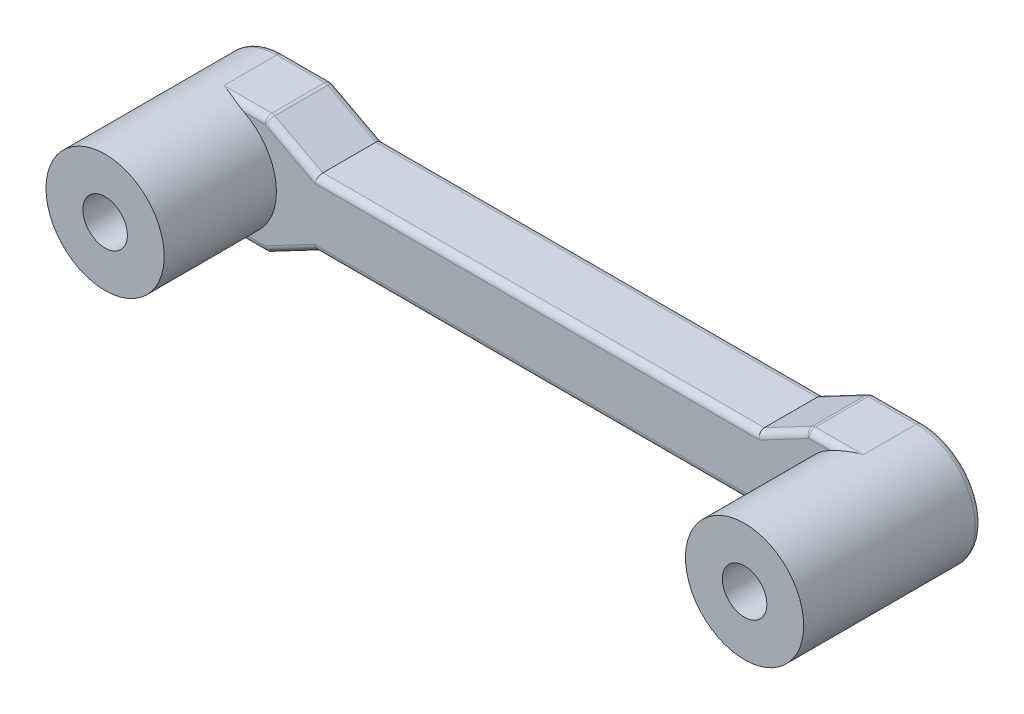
from build123d import *

# Parameters (mm, degrees)
SKETCH1_R           = 3.048
BOSS_EXTRUDE1_DEPTH = 5.08
CUT_EXTRUDE1_DEPTH  = 30.940958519
BOSS_EXTRUDE2_START = -5.08
SKETCH3_R           = 3.048
BOSS_EXTRUDE2_DEPTH = 5.08
FILLET1_R           = 0.508
SKETCH4_R           = 1.7145
CUT_EXTRUDE2_DEPTH  = 30.940958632
BOSS_EXTRUDE3_START = 4.572
SKETCH5_R           = 1.7145
BOSS_EXTRUDE3_DEPTH = 9.144


with BuildPart() as part:
    # Sketch1 → Boss-Extrude1 (new body)
    with BuildSketch(Plane.XY):
        with BuildLine():
            Line((-24.60625, 4.548), (24.60625, 4.548))
            ThreePointArc((24.60625, 4.548), (29.15425, 0), (24.60625, -4.548))
            Line((24.60625, -4.548), (-24.60625, -4.548))
            ThreePointArc((-24.60625, -4.548), (-29.15425, 0), (-24.60625, 4.548))
        make_face()
        with Locations((-24.60625, 0)):
            Circle(SKETCH1_R, mode=Mode.SUBTRACT)
        with Locations((24.60625, 0)):
            Circle(SKETCH1_R, mode=Mode.SUBTRACT)
    extrude(amount=BOSS_EXTRUDE1_DEPTH)

    # Sketch2 → Cut-Extrude1 (cut, through all)
    with BuildSketch(Plane.XY):
        Polygon((-20.79625, 4.548), (-16.98625, 2.54), (16.98625, 2.54), (20.79625, 4.548), align=None)
        Polygon((-16.98625, -2.54), (16.98625, -2.54), (20.79625, -4.548), (-20.79625, -4.548), align=None)
    extrude(amount=CUT_EXTRUDE1_DEPTH, mode=Mode.SUBTRACT)

    # Sketch3 → Boss-Extrude2 (add)
    with BuildSketch(Plane.XY.offset(5.08).offset(BOSS_EXTRUDE2_START)):
        with Locations((-24.60625, 0)):
            Circle(SKETCH3_R)
    boss_extrude2 = extrude(amount=BOSS_EXTRUDE2_DEPTH)

    # Mirror1: Boss-Extrude2 across plane
    add(boss_extrude2.mirror(Plane(origin=(0, 0, 0), x_dir=(0, 0, 1), z_dir=(1, 0, 0))))

    # Fillet1
    fillet1_edges = [part.edges().sort_by_distance(p)[0] for p in [
        (29.15425, 0, 5.08),
        (22.70125, 4.548, 5.08),
        (-22.70125, 4.548, 0),
        (-22.70125, 4.548, 5.08),
        (20.79625, 4.548, 2.54),
        (-18.89125, 3.544, 0),
        (-20.79625, 4.548, 2.54),
        (0, 2.54, 0),
        (18.89125, 3.544, 0),
        (-18.89125, 3.544, 5.08),
        (0, 2.54, 5.08),
        (18.89125, 3.544, 5.08),
        (22.70125, -4.548, 0),
        (22.70125, -4.548, 5.08),
        (-29.15425, 0, 5.08),
        (-18.89125, -3.544, 0),
        (18.89125, -3.544, 0),
        (0, -2.54, 0),
        (-18.89125, -3.544, 5.08),
        (18.89125, -3.544, 5.08),
        (0, -2.54, 5.08),
        (22.70125, 4.548, 0),
        (29.15425, 0, 0),
        (-22.70125, -4.548, 0),
        (-29.15425, 0, 0),
        (-22.70125, -4.548, 5.08),
    ]]
    fillet(fillet1_edges, radius=FILLET1_R)

    # Sketch4 → Cut-Extrude2 (cut, through all)
    with BuildSketch(Plane.XY.offset(5.08)):
        with Locations((-24.60625, 0)):
            Circle(SKETCH4_R)
    cut_extrude2 = extrude(amount=-CUT_EXTRUDE2_DEPTH, mode=Mode.SUBTRACT)

    # Mirror2: Cut-Extrude2 across plane
    add(cut_extrude2.mirror(Plane(origin=(0, 0, 0), x_dir=(0, 0, 1), z_dir=(1, 0, 0))), mode=Mode.SUBTRACT)

    # Sketch5 → Boss-Extrude3 (add)
    with BuildSketch(Plane.XY.offset(BOSS_EXTRUDE3_START)):
        with BuildLine():
            ThreePointArc((-24.60625, 4.548), (-29.15425, 0), (-24.60625, -4.548))
            ThreePointArc((-24.60625, -4.548), (-20.05825, 0), (-24.60625, 4.548))
        make_face()
        with Locations((-24.60625, 0)):
            Circle(SKETCH5_R, mode=Mode.SUBTRACT)
    boss_extrude3 = extrude(amount=BOSS_EXTRUDE3_DEPTH)

    # Mirror3: Boss-Extrude3 across plane
    add(boss_extrude3.mirror(Plane(origin=(0, 0, 0), x_dir=(0, 0, 1), z_dir=(1, 0, 0))))


solid = part.part
